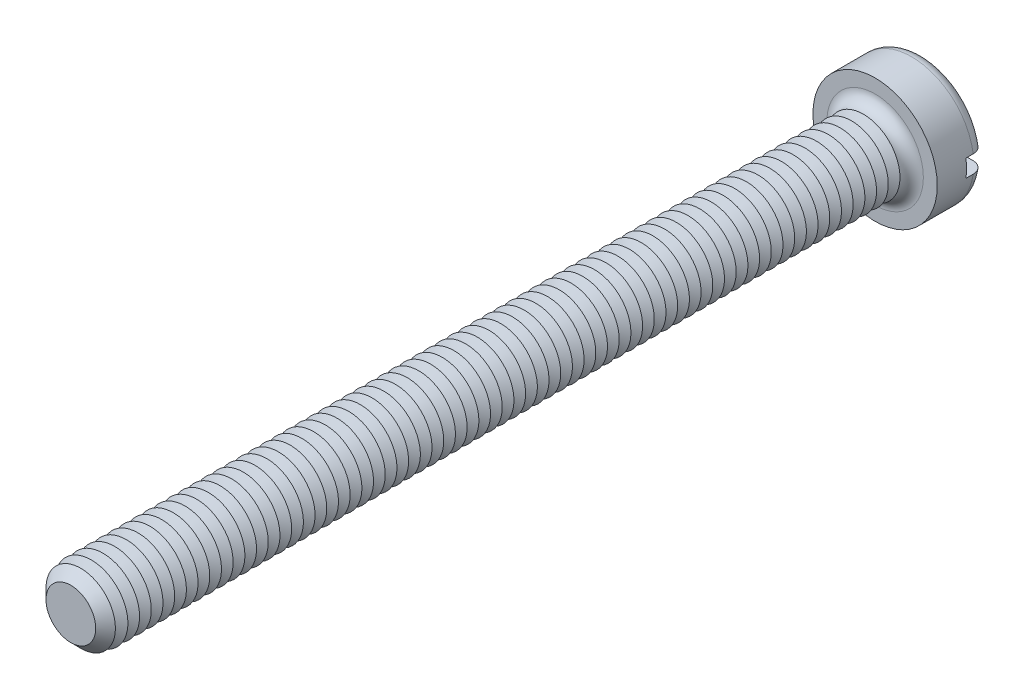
from build123d import *

# Parameters (mm, degrees)
SKETCH3_R           = 4.25
BOSS_EXTRUDE2_DEPTH = 3.3
SKETCH4_R           = 2.5
BOSS_EXTRUDE3_DEPTH = 55
FILLET1_R           = 0.8
CHAMFER1_SIZE       = 0.8
LPATTERN1_COUNT     = 67
LPATTERN1_PITCH     = 0.8
SKETCH8_W           = 8.5
SKETCH8_H           = 1.2
CUT_EXTRUDE1_DEPTH  = 1.3


with BuildPart() as part:
    # Sketch3 → Boss-Extrude2 (new body)
    with BuildSketch(Plane.XY):
        Circle(SKETCH3_R)
    extrude(amount=-BOSS_EXTRUDE2_DEPTH)

    # Sketch4 → Boss-Extrude3 (add)
    with BuildSketch(Plane.XY):
        Circle(SKETCH4_R)
    extrude(amount=BOSS_EXTRUDE3_DEPTH)

    # Fillet1
    fillet1_edges = [part.edges().sort_by_distance(p)[0] for p in [
        (-4.25, 0, -3.3),
        (-2.5, 0, 0),
    ]]
    fillet(fillet1_edges, radius=FILLET1_R)

    # Chamfer1
    chamfer1_edges = [part.edges().sort_by_distance(p)[0] for p in [
        (-2.5, 0, 55),
    ]]
    chamfer(chamfer1_edges, length=CHAMFER1_SIZE)

    # Sketch6 → Cut-Revolve1 (revolve, cut)
    with BuildSketch(Plane(origin=(0, 0, 0), x_dir=(0, 0, -1), z_dir=(1, 0, 0)), mode=Mode.PRIVATE) as cut_revolve1_sk:
        Polygon((-0.8, 2.5), (-1.2, 1.807179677), (-1.6, 2.5), align=None)
    cut_revolve1 = revolve(cut_revolve1_sk.sketch.rotate(Axis((0, 0, -1.694361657), (0, 0, 1)), 90), axis=Axis((0, 0, -1.694361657), (0, 0, 1)), mode=Mode.SUBTRACT)

    # LPattern1: Cut-Revolve1 ×67
    with Locations(*[(0, 0, i * LPATTERN1_PITCH) for i in range(1, LPATTERN1_COUNT)]):
        add(cut_revolve1, mode=Mode.SUBTRACT)

    # Sketch8 → Cut-Extrude1 (cut)
    with BuildSketch(Plane(origin=(0, 0, -3.3), x_dir=(-1, 0, 0), z_dir=(0, 0, -1))):
        Rectangle(SKETCH8_W, SKETCH8_H)
    extrude(amount=-CUT_EXTRUDE1_DEPTH, mode=Mode.SUBTRACT)


solid = part.part
